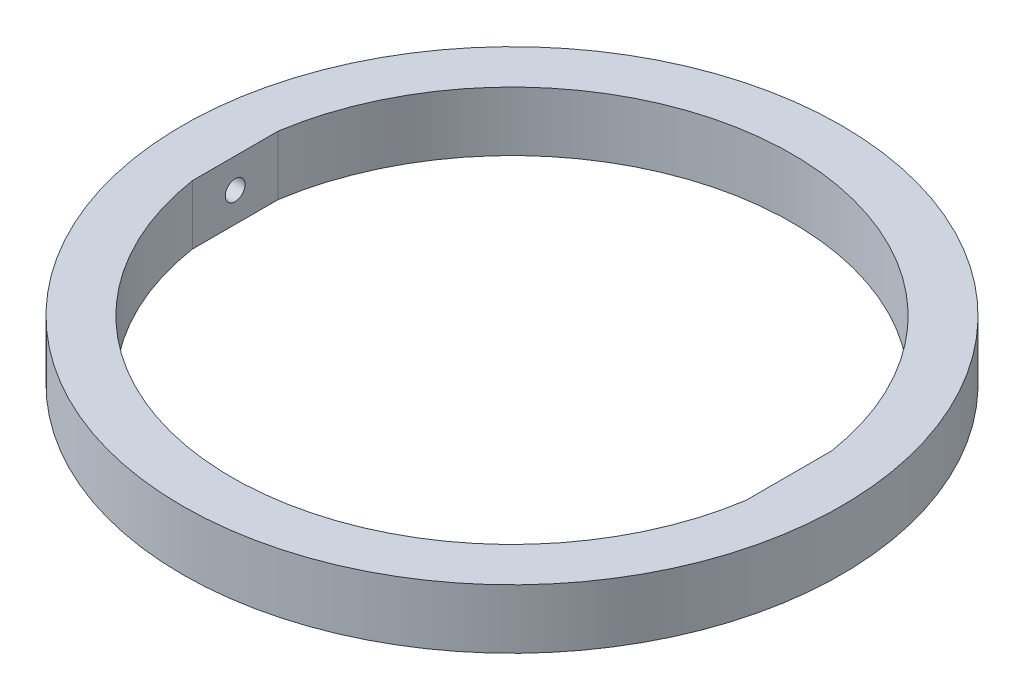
from build123d import *

# Parameters (mm, degrees)
SKETCH1_R               = 50
SKETCH1_R_2             = 42.5
BOSS_EXTRUDE1_DEPTH     = 9
BOSS_EXTRUDE2_START     = -9
BOSS_EXTRUDE2_DEPTH     = 9
CUT_EXTRUDE1_DEPTH      = 89
CUT_EXTRUDE1_DEPTH_BACK = 5
SKETCH3_R               = 1.5


with BuildPart() as part:
    # Sketch1 → Boss-Extrude1 (new body)
    with BuildSketch(Plane(origin=(0, 0, 0), x_dir=(1, 0, 0), z_dir=(0, 1, 0))):
        with Locations(Location((0, 0, 0), (0, 0, 270))):
            Circle(SKETCH1_R)
        with Locations(Location((0, 0, 0), (0, 0, 270))):
            Circle(SKETCH1_R_2, mode=Mode.SUBTRACT)
    extrude(amount=BOSS_EXTRUDE1_DEPTH)

    # Sketch2 → Boss-Extrude2 (add)
    with BuildSketch(Plane(origin=(0, 9, 0), x_dir=(1, 0, 0), z_dir=(0, 1, 0)).offset(BOSS_EXTRUDE2_START)):
        with BuildLine():
            ThreePointArc((-42, 6.5), (-42.5, 0), (-42, -6.5))
            Line((-42, -6.5), (-42, 6.5))
        make_face()
        with BuildLine():
            Line((42, 6.5), (42, -6.5))
            ThreePointArc((42, -6.5), (42.374815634, -3.259601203), (42.5, 0))
            ThreePointArc((42.5, 0), (42.374815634, 3.259601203), (42, 6.5))
        make_face()
    extrude(amount=BOSS_EXTRUDE2_DEPTH)

    # Sketch3 → Cut-Extrude1 (cut, two sides: drawn at the far end of the back side and taken through both)
    with BuildSketch(Plane(origin=(-42, 0, 0), x_dir=(0, 0, -1), z_dir=(1, 0, 0)).offset(-CUT_EXTRUDE1_DEPTH_BACK)):
        with Locations((0, 4.5)):
            Circle(SKETCH3_R)
    extrude(amount=CUT_EXTRUDE1_DEPTH + CUT_EXTRUDE1_DEPTH_BACK, mode=Mode.SUBTRACT)


solid = part.part
